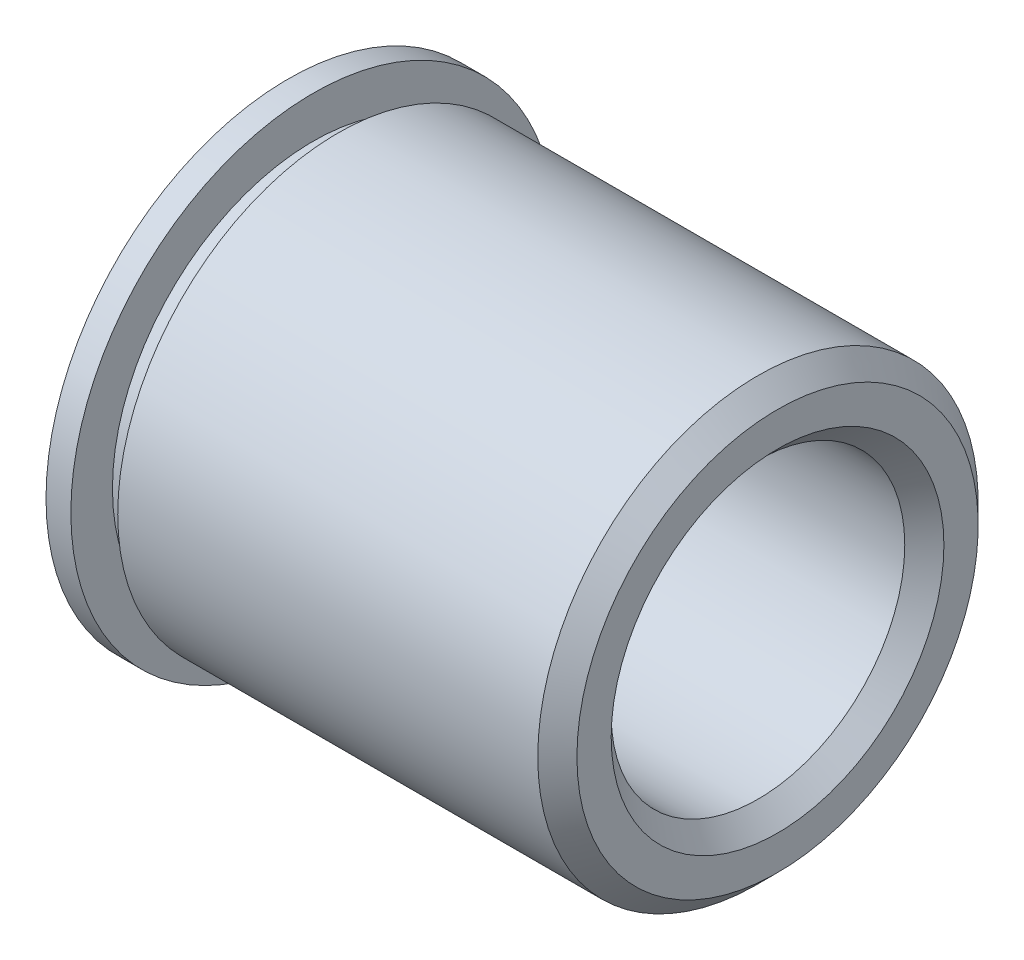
ISO-10303-21;
HEADER;
FILE_DESCRIPTION(('STEP AP214'),'2;1');
FILE_NAME('part.step','',(''),(''),'','','');
FILE_SCHEMA(('AUTOMOTIVE_DESIGN { 1 0 10303 214 1 1 1 1 }'));
ENDSEC;
DATA;
#1=APPLICATION_CONTEXT('core data for automotive mechanical design processes');
#2=APPLICATION_PROTOCOL_DEFINITION('international standard','automotive_design',2000,#1);
#3=PRODUCT_CONTEXT('',#1,'mechanical');
#4=PRODUCT('Part','Part','',(#3));
#5=PRODUCT_RELATED_PRODUCT_CATEGORY('part','',(#4));
#6=PRODUCT_DEFINITION_FORMATION('','',#4);
#7=PRODUCT_DEFINITION_CONTEXT('part definition',#1,'design');
#8=PRODUCT_DEFINITION('design','',#6,#7);
#9=PRODUCT_DEFINITION_SHAPE('','',#8);
#10=(LENGTH_UNIT() NAMED_UNIT(*) SI_UNIT(.MILLI.,.METRE.));
#11=(NAMED_UNIT(*) PLANE_ANGLE_UNIT() SI_UNIT($,.RADIAN.));
#12=(NAMED_UNIT(*) SI_UNIT($,.STERADIAN.) SOLID_ANGLE_UNIT());
#13=UNCERTAINTY_MEASURE_WITH_UNIT(LENGTH_MEASURE(1.E-05),#10,'distance_accuracy_value','');
#14=(GEOMETRIC_REPRESENTATION_CONTEXT(3) GLOBAL_UNCERTAINTY_ASSIGNED_CONTEXT((#13)) GLOBAL_UNIT_ASSIGNED_CONTEXT((#10,
#11,#12)) REPRESENTATION_CONTEXT('',''));
#15=CARTESIAN_POINT('',(0.,0.,0.));
#16=DIRECTION('',(0.,0.,1.));
#17=DIRECTION('',(1.,0.,0.));
#18=AXIS2_PLACEMENT_3D('',#15,#16,#17);
#19=CARTESIAN_POINT('',(74.2136725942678,0.,0.));
#20=DIRECTION('',(-1.,0.,0.));
#21=DIRECTION('',(0.,0.,1.));
#22=AXIS2_PLACEMENT_3D('',#19,#20,#21);
#23=PLANE('',#22);
#24=CARTESIAN_POINT('',(74.2136725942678,0.,0.));
#25=DIRECTION('',(-1.,0.,0.));
#26=DIRECTION('',(0.,0.,1.));
#27=AXIS2_PLACEMENT_3D('',#24,#25,#26);
#28=CIRCLE('',#27,1.7);
#29=CARTESIAN_POINT('',(74.2136725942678,0.,1.7));
#30=VERTEX_POINT('',#29);
#31=EDGE_CURVE('E10',#30,#30,#28,.T.);
#32=ORIENTED_EDGE('',*,*,#31,.T.);
#33=EDGE_LOOP('',(#32));
#34=FACE_BOUND('',#33,.T.);
#35=CARTESIAN_POINT('',(74.2136725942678,0.,0.));
#36=DIRECTION('',(-1.,0.,0.));
#37=DIRECTION('',(0.,0.,1.));
#38=AXIS2_PLACEMENT_3D('',#35,#36,#37);
#39=CIRCLE('',#38,2.04999999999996);
#40=CARTESIAN_POINT('',(74.2136725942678,0.,2.04999999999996));
#41=VERTEX_POINT('',#40);
#42=EDGE_CURVE('E52',#41,#41,#39,.F.);
#43=ORIENTED_EDGE('',*,*,#42,.T.);
#44=EDGE_LOOP('',(#43));
#45=FACE_BOUND('',#44,.T.);
#46=ADVANCED_FACE('F32',(#34,#45),#23,.F.);
#47=CARTESIAN_POINT('',(-67.8249023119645,0.,0.));
#48=DIRECTION('',(-1.,0.,0.));
#49=DIRECTION('',(0.,0.,1.));
#50=AXIS2_PLACEMENT_3D('',#47,#48,#49);
#51=CYLINDRICAL_SURFACE('',#50,2.25);
#52=CARTESIAN_POINT('',(74.0136725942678,0.,0.));
#53=DIRECTION('',(-1.,0.,0.));
#54=DIRECTION('',(0.,0.,1.));
#55=AXIS2_PLACEMENT_3D('',#52,#53,#54);
#56=CIRCLE('',#55,2.25);
#57=CARTESIAN_POINT('',(74.0136725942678,0.,2.25));
#58=VERTEX_POINT('',#57);
#59=EDGE_CURVE('E55',#58,#58,#56,.T.);
#60=ORIENTED_EDGE('',*,*,#59,.T.);
#61=EDGE_LOOP('',(#60));
#62=FACE_BOUND('',#61,.T.);
#63=CARTESIAN_POINT('',(69.7216725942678,0.,0.));
#64=DIRECTION('',(-1.,0.,0.));
#65=DIRECTION('',(0.,0.,1.));
#66=AXIS2_PLACEMENT_3D('',#63,#64,#65);
#67=CIRCLE('',#66,2.25);
#68=CARTESIAN_POINT('',(69.7216725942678,0.,2.25));
#69=VERTEX_POINT('',#68);
#70=EDGE_CURVE('E58',#69,#69,#67,.T.);
#71=ORIENTED_EDGE('',*,*,#70,.F.);
#72=EDGE_LOOP('',(#71));
#73=FACE_BOUND('',#72,.T.);
#74=ADVANCED_FACE('F97',(#62,#73),#51,.T.);
#75=CARTESIAN_POINT('',(69.7216725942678,2.25,0.));
#76=DIRECTION('',(1.,0.,0.));
#77=DIRECTION('',(0.,0.,-1.));
#78=AXIS2_PLACEMENT_3D('',#75,#76,#77);
#79=PLANE('',#78);
#80=CARTESIAN_POINT('',(69.7216725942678,0.,0.));
#81=DIRECTION('',(-1.,0.,0.));
#82=DIRECTION('',(0.,0.,1.));
#83=AXIS2_PLACEMENT_3D('',#80,#81,#82);
#84=CIRCLE('',#83,2.05);
#85=CARTESIAN_POINT('',(69.7216725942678,0.,2.05));
#86=VERTEX_POINT('',#85);
#87=EDGE_CURVE('E61',#86,#86,#84,.T.);
#88=ORIENTED_EDGE('',*,*,#87,.F.);
#89=EDGE_LOOP('',(#88));
#90=FACE_BOUND('',#89,.T.);
#91=ORIENTED_EDGE('',*,*,#70,.T.);
#92=EDGE_LOOP('',(#91));
#93=FACE_BOUND('',#92,.T.);
#94=ADVANCED_FACE('F91',(#90,#93),#79,.F.);
#95=CARTESIAN_POINT('',(-67.8249023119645,0.,0.));
#96=DIRECTION('',(-1.,0.,0.));
#97=DIRECTION('',(0.,0.,1.));
#98=AXIS2_PLACEMENT_3D('',#95,#96,#97);
#99=CYLINDRICAL_SURFACE('',#98,2.05);
#100=CARTESIAN_POINT('',(69.4676725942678,0.,0.));
#101=DIRECTION('',(-1.,0.,0.));
#102=DIRECTION('',(0.,0.,1.));
#103=AXIS2_PLACEMENT_3D('',#100,#101,#102);
#104=CIRCLE('',#103,2.05);
#105=CARTESIAN_POINT('',(69.4676725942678,0.,2.05));
#106=VERTEX_POINT('',#105);
#107=EDGE_CURVE('E64',#106,#106,#104,.T.);
#108=ORIENTED_EDGE('',*,*,#107,.F.);
#109=EDGE_LOOP('',(#108));
#110=FACE_BOUND('',#109,.T.);
#111=ORIENTED_EDGE('',*,*,#87,.T.);
#112=EDGE_LOOP('',(#111));
#113=FACE_BOUND('',#112,.T.);
#114=ADVANCED_FACE('F85',(#110,#113),#99,.T.);
#115=CARTESIAN_POINT('',(69.4676725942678,2.05,0.));
#116=DIRECTION('',(-1.,0.,0.));
#117=DIRECTION('',(0.,0.,1.));
#118=AXIS2_PLACEMENT_3D('',#115,#116,#117);
#119=PLANE('',#118);
#120=CARTESIAN_POINT('',(69.4676725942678,0.,0.));
#121=DIRECTION('',(-1.,0.,0.));
#122=DIRECTION('',(0.,0.,1.));
#123=AXIS2_PLACEMENT_3D('',#120,#121,#122);
#124=CIRCLE('',#123,2.475);
#125=CARTESIAN_POINT('',(69.4676725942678,0.,2.475));
#126=VERTEX_POINT('',#125);
#127=EDGE_CURVE('E67',#126,#126,#124,.T.);
#128=ORIENTED_EDGE('',*,*,#127,.F.);
#129=EDGE_LOOP('',(#128));
#130=FACE_BOUND('',#129,.T.);
#131=ORIENTED_EDGE('',*,*,#107,.T.);
#132=EDGE_LOOP('',(#131));
#133=FACE_BOUND('',#132,.T.);
#134=ADVANCED_FACE('F79',(#130,#133),#119,.F.);
#135=CARTESIAN_POINT('',(-67.8249023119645,0.,0.));
#136=DIRECTION('',(-1.,0.,0.));
#137=DIRECTION('',(0.,0.,1.));
#138=AXIS2_PLACEMENT_3D('',#135,#136,#137);
#139=CYLINDRICAL_SURFACE('',#138,2.475);
#140=CARTESIAN_POINT('',(69.2136725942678,0.,0.));
#141=DIRECTION('',(-1.,0.,0.));
#142=DIRECTION('',(0.,0.,1.));
#143=AXIS2_PLACEMENT_3D('',#140,#141,#142);
#144=CIRCLE('',#143,2.475);
#145=CARTESIAN_POINT('',(69.2136725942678,0.,2.475));
#146=VERTEX_POINT('',#145);
#147=EDGE_CURVE('E70',#146,#146,#144,.T.);
#148=ORIENTED_EDGE('',*,*,#147,.F.);
#149=EDGE_LOOP('',(#148));
#150=FACE_BOUND('',#149,.T.);
#151=ORIENTED_EDGE('',*,*,#127,.T.);
#152=EDGE_LOOP('',(#151));
#153=FACE_BOUND('',#152,.T.);
#154=ADVANCED_FACE('F76',(#150,#153),#139,.T.);
#155=CARTESIAN_POINT('',(69.2136725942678,2.475,0.));
#156=DIRECTION('',(1.,0.,0.));
#157=DIRECTION('',(0.,0.,-1.));
#158=AXIS2_PLACEMENT_3D('',#155,#156,#157);
#159=PLANE('',#158);
#160=CARTESIAN_POINT('',(69.2136725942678,0.,0.));
#161=DIRECTION('',(1.,0.,0.));
#162=DIRECTION('',(0.,0.,-1.));
#163=AXIS2_PLACEMENT_3D('',#160,#161,#162);
#164=CIRCLE('',#163,1.7);
#165=CARTESIAN_POINT('',(69.2136725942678,0.,-1.7));
#166=VERTEX_POINT('',#165);
#167=EDGE_CURVE('E47',#166,#166,#164,.T.);
#168=ORIENTED_EDGE('',*,*,#167,.T.);
#169=EDGE_LOOP('',(#168));
#170=FACE_BOUND('',#169,.T.);
#171=ORIENTED_EDGE('',*,*,#147,.T.);
#172=EDGE_LOOP('',(#171));
#173=FACE_BOUND('',#172,.T.);
#174=ADVANCED_FACE('F74',(#170,#173),#159,.F.);
#175=CARTESIAN_POINT('',(69.2136725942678,0.,0.));
#176=DIRECTION('',(1.,0.,0.));
#177=DIRECTION('',(0.,0.,-1.));
#178=AXIS2_PLACEMENT_3D('',#175,#176,#177);
#179=CYLINDRICAL_SURFACE('',#178,1.5);
#180=CARTESIAN_POINT('',(69.4136725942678,0.,0.));
#181=DIRECTION('',(1.,0.,0.));
#182=DIRECTION('',(0.,0.,-1.));
#183=AXIS2_PLACEMENT_3D('',#180,#181,#182);
#184=CIRCLE('',#183,1.5);
#185=CARTESIAN_POINT('',(69.4136725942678,0.,-1.5));
#186=VERTEX_POINT('',#185);
#187=EDGE_CURVE('E39',#186,#186,#184,.F.);
#188=ORIENTED_EDGE('',*,*,#187,.T.);
#189=EDGE_LOOP('',(#188));
#190=FACE_BOUND('',#189,.T.);
#191=CARTESIAN_POINT('',(74.0136725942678,0.,0.));
#192=DIRECTION('',(-1.,0.,0.));
#193=DIRECTION('',(0.,0.,1.));
#194=AXIS2_PLACEMENT_3D('',#191,#192,#193);
#195=CIRCLE('',#194,1.5);
#196=CARTESIAN_POINT('',(74.0136725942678,0.,1.5));
#197=VERTEX_POINT('',#196);
#198=EDGE_CURVE('E43',#197,#197,#195,.F.);
#199=ORIENTED_EDGE('',*,*,#198,.T.);
#200=EDGE_LOOP('',(#199));
#201=FACE_BOUND('',#200,.T.);
#202=ADVANCED_FACE('F112',(#190,#201),#179,.F.);
#203=CARTESIAN_POINT('',(74.0136725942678,0.,0.));
#204=DIRECTION('',(-1.,0.,0.));
#205=DIRECTION('',(0.,0.,1.));
#206=AXIS2_PLACEMENT_3D('',#203,#204,#205);
#207=CONICAL_SURFACE('',#206,2.25,0.785398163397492);
#208=ORIENTED_EDGE('',*,*,#42,.F.);
#209=EDGE_LOOP('',(#208));
#210=FACE_BOUND('',#209,.T.);
#211=ORIENTED_EDGE('',*,*,#59,.F.);
#212=EDGE_LOOP('',(#211));
#213=FACE_BOUND('',#212,.T.);
#214=ADVANCED_FACE('F109',(#210,#213),#207,.T.);
#215=CARTESIAN_POINT('',(69.2136725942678,0.,0.));
#216=DIRECTION('',(-1.,0.,0.));
#217=DIRECTION('',(0.,0.,1.));
#218=AXIS2_PLACEMENT_3D('',#215,#216,#217);
#219=CONICAL_SURFACE('',#218,1.7,0.785398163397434);
#220=ORIENTED_EDGE('',*,*,#187,.F.);
#221=EDGE_LOOP('',(#220));
#222=FACE_BOUND('',#221,.T.);
#223=ORIENTED_EDGE('',*,*,#167,.F.);
#224=EDGE_LOOP('',(#223));
#225=FACE_BOUND('',#224,.T.);
#226=ADVANCED_FACE('F111',(#222,#225),#219,.F.);
#227=CARTESIAN_POINT('',(74.0136725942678,0.,0.));
#228=DIRECTION('',(1.,0.,0.));
#229=DIRECTION('',(0.,0.,-1.));
#230=AXIS2_PLACEMENT_3D('',#227,#228,#229);
#231=CONICAL_SURFACE('',#230,1.5,0.785398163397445);
#232=ORIENTED_EDGE('',*,*,#31,.F.);
#233=EDGE_LOOP('',(#232));
#234=FACE_BOUND('',#233,.T.);
#235=ORIENTED_EDGE('',*,*,#198,.F.);
#236=EDGE_LOOP('',(#235));
#237=FACE_BOUND('',#236,.T.);
#238=ADVANCED_FACE('F34',(#234,#237),#231,.F.);
#239=CLOSED_SHELL('',(#46,#74,#94,#114,#134,#154,#174,#202,#214,#226,#238));
#240=MANIFOLD_SOLID_BREP('B2',#239);
#241=ADVANCED_BREP_SHAPE_REPRESENTATION('',(#18,#240),#14);
#242=SHAPE_DEFINITION_REPRESENTATION(#9,#241);
ENDSEC;
END-ISO-10303-21;
